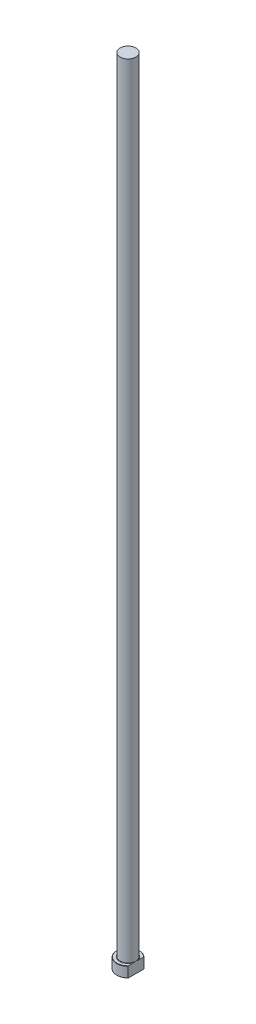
from build123d import *
from build123d.topology import SkipClean

# Parameters (mm, degrees)
CHAMFER1_SIZE    = 0.2
FILLET1_R        = 0.3
KEYED_HEAD_DEPTH = 601.120404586


with BuildPart() as part:
    # Sketch1 → Revolve1 (revolve)
    with BuildSketch(Plane.XY, mode=Mode.PRIVATE) as revolve1_sk:
        Polygon((0, 0), (-8.5, 0), (-8.5, 8), (-6, 8), (-6, 600), (0, 600), align=None)
    revolve(revolve1_sk.sketch.rotate(Axis((0, 259.958771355, 0), (0, -1, 0)), 270), axis=Axis((0, 259.958771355, 0), (0, -1, 0)))

    # Chamfer1
    chamfer1_edges = [part.edges().sort_by_distance(p)[0] for p in [
        (0, 8, -8.5),
        (0, 0, -8.5),
    ]]
    chamfer(chamfer1_edges, length=CHAMFER1_SIZE)

    # Fillet1
    fillet1_edges = [part.edges().sort_by_distance(p)[0] for p in [
        (0, 8, -6),
    ]]
    fillet(fillet1_edges, radius=FILLET1_R)

    # Sketch2 → KEYED HEAD (cut, through all)
    with SkipClean():  # the faces are left unmerged after this step: merging them gives an invalid solid
        with BuildSketch(Plane(origin=(0, 0, 0), x_dir=(1, 0, 0), z_dir=(0, 1, 0))):
            with BuildLine():
                Line((6, -6.020797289), (6, 6.020797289))
                ThreePointArc((6, 6.020797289), (8.5, 0), (6, -6.020797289))
            make_face()
        extrude(amount=KEYED_HEAD_DEPTH, mode=Mode.SUBTRACT)


solid = part.part
